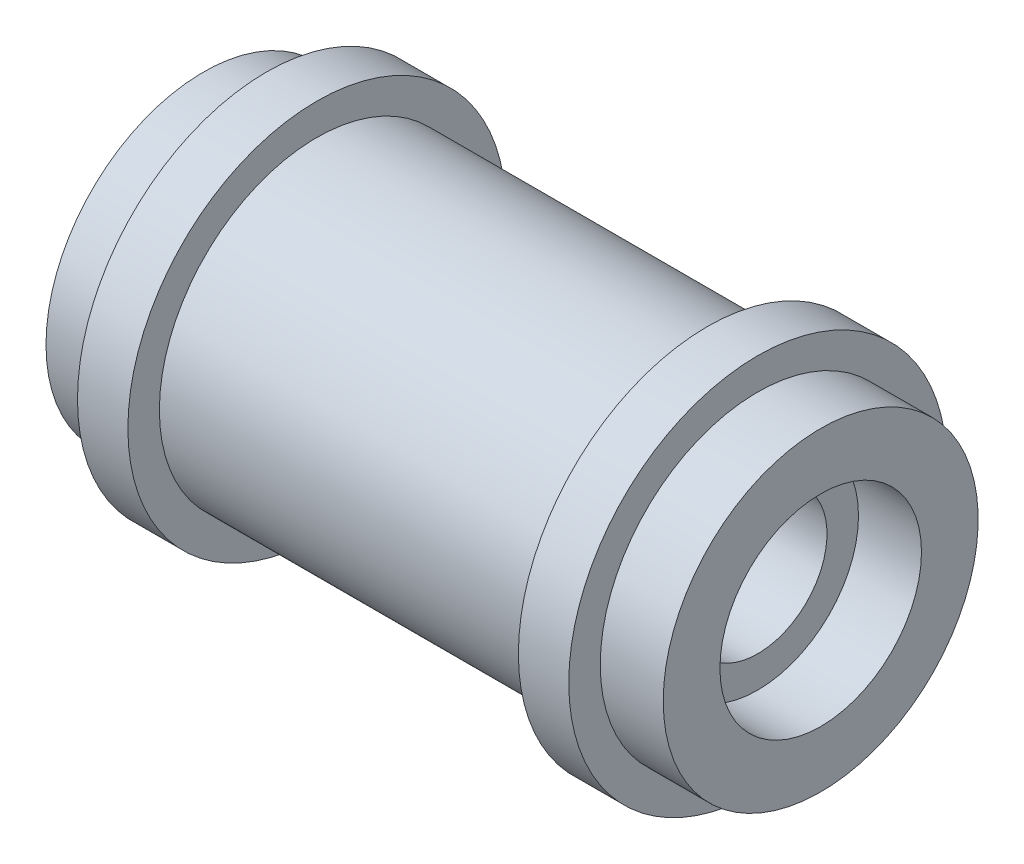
ISO-10303-21;
HEADER;
FILE_DESCRIPTION(('STEP AP214'),'2;1');
FILE_NAME('part.step','',(''),(''),'','','');
FILE_SCHEMA(('AUTOMOTIVE_DESIGN { 1 0 10303 214 1 1 1 1 }'));
ENDSEC;
DATA;
#1=APPLICATION_CONTEXT('core data for automotive mechanical design processes');
#2=APPLICATION_PROTOCOL_DEFINITION('international standard','automotive_design',2000,#1);
#3=PRODUCT_CONTEXT('',#1,'mechanical');
#4=PRODUCT('Part','Part','',(#3));
#5=PRODUCT_RELATED_PRODUCT_CATEGORY('part','',(#4));
#6=PRODUCT_DEFINITION_FORMATION('','',#4);
#7=PRODUCT_DEFINITION_CONTEXT('part definition',#1,'design');
#8=PRODUCT_DEFINITION('design','',#6,#7);
#9=PRODUCT_DEFINITION_SHAPE('','',#8);
#10=(LENGTH_UNIT() NAMED_UNIT(*) SI_UNIT(.MILLI.,.METRE.));
#11=(NAMED_UNIT(*) PLANE_ANGLE_UNIT() SI_UNIT($,.RADIAN.));
#12=(NAMED_UNIT(*) SI_UNIT($,.STERADIAN.) SOLID_ANGLE_UNIT());
#13=UNCERTAINTY_MEASURE_WITH_UNIT(LENGTH_MEASURE(1.E-05),#10,'distance_accuracy_value','');
#14=(GEOMETRIC_REPRESENTATION_CONTEXT(3) GLOBAL_UNCERTAINTY_ASSIGNED_CONTEXT((#13)) GLOBAL_UNIT_ASSIGNED_CONTEXT((#10,
#11,#12)) REPRESENTATION_CONTEXT('',''));
#15=CARTESIAN_POINT('',(0.,0.,0.));
#16=DIRECTION('',(0.,0.,1.));
#17=DIRECTION('',(1.,0.,0.));
#18=AXIS2_PLACEMENT_3D('',#15,#16,#17);
#19=CARTESIAN_POINT('',(-49.,25.,0.));
#20=DIRECTION('',(1.,0.,0.));
#21=DIRECTION('',(0.,0.,-1.));
#22=AXIS2_PLACEMENT_3D('',#19,#20,#21);
#23=PLANE('',#22);
#24=CARTESIAN_POINT('',(-49.,0.,0.));
#25=DIRECTION('',(-1.,0.,0.));
#26=DIRECTION('',(0.,0.,1.));
#27=AXIS2_PLACEMENT_3D('',#24,#25,#26);
#28=CIRCLE('',#27,16.);
#29=CARTESIAN_POINT('',(-49.,0.,16.));
#30=VERTEX_POINT('',#29);
#31=EDGE_CURVE('E10',#30,#30,#28,.T.);
#32=ORIENTED_EDGE('',*,*,#31,.F.);
#33=EDGE_LOOP('',(#32));
#34=FACE_BOUND('',#33,.T.);
#35=CARTESIAN_POINT('',(-49.,0.,0.));
#36=DIRECTION('',(-1.,0.,0.));
#37=DIRECTION('',(0.,0.,1.));
#38=AXIS2_PLACEMENT_3D('',#35,#36,#37);
#39=CIRCLE('',#38,25.);
#40=CARTESIAN_POINT('',(-49.,0.,25.));
#41=VERTEX_POINT('',#40);
#42=EDGE_CURVE('E80',#41,#41,#39,.T.);
#43=ORIENTED_EDGE('',*,*,#42,.T.);
#44=EDGE_LOOP('',(#43));
#45=FACE_BOUND('',#44,.T.);
#46=ADVANCED_FACE('F28',(#34,#45),#23,.F.);
#47=CARTESIAN_POINT('',(-49.,0.,0.));
#48=DIRECTION('',(-1.,0.,0.));
#49=DIRECTION('',(0.,0.,1.));
#50=AXIS2_PLACEMENT_3D('',#47,#48,#49);
#51=CYLINDRICAL_SURFACE('',#50,16.);
#52=CARTESIAN_POINT('',(-39.,0.,0.));
#53=DIRECTION('',(-1.,0.,0.));
#54=DIRECTION('',(0.,0.,1.));
#55=AXIS2_PLACEMENT_3D('',#52,#53,#54);
#56=CIRCLE('',#55,16.);
#57=CARTESIAN_POINT('',(-39.,0.,16.));
#58=VERTEX_POINT('',#57);
#59=EDGE_CURVE('E34',#58,#58,#56,.T.);
#60=ORIENTED_EDGE('',*,*,#59,.F.);
#61=EDGE_LOOP('',(#60));
#62=FACE_BOUND('',#61,.T.);
#63=ORIENTED_EDGE('',*,*,#31,.T.);
#64=EDGE_LOOP('',(#63));
#65=FACE_BOUND('',#64,.T.);
#66=ADVANCED_FACE('F165',(#62,#65),#51,.F.);
#67=CARTESIAN_POINT('',(-39.,16.,0.));
#68=DIRECTION('',(1.,0.,0.));
#69=DIRECTION('',(0.,0.,-1.));
#70=AXIS2_PLACEMENT_3D('',#67,#68,#69);
#71=PLANE('',#70);
#72=CARTESIAN_POINT('',(-39.,0.,0.));
#73=DIRECTION('',(-1.,0.,0.));
#74=DIRECTION('',(0.,0.,1.));
#75=AXIS2_PLACEMENT_3D('',#72,#73,#74);
#76=CIRCLE('',#75,11.);
#77=CARTESIAN_POINT('',(-39.,0.,11.));
#78=VERTEX_POINT('',#77);
#79=EDGE_CURVE('E38',#78,#78,#76,.T.);
#80=ORIENTED_EDGE('',*,*,#79,.F.);
#81=EDGE_LOOP('',(#80));
#82=FACE_BOUND('',#81,.T.);
#83=ORIENTED_EDGE('',*,*,#59,.T.);
#84=EDGE_LOOP('',(#83));
#85=FACE_BOUND('',#84,.T.);
#86=ADVANCED_FACE('F160',(#82,#85),#71,.F.);
#87=CARTESIAN_POINT('',(-49.,0.,0.));
#88=DIRECTION('',(-1.,0.,0.));
#89=DIRECTION('',(0.,0.,1.));
#90=AXIS2_PLACEMENT_3D('',#87,#88,#89);
#91=CYLINDRICAL_SURFACE('',#90,11.);
#92=CARTESIAN_POINT('',(39.,0.,0.));
#93=DIRECTION('',(-1.,0.,0.));
#94=DIRECTION('',(0.,0.,1.));
#95=AXIS2_PLACEMENT_3D('',#92,#93,#94);
#96=CIRCLE('',#95,11.);
#97=CARTESIAN_POINT('',(39.,0.,11.));
#98=VERTEX_POINT('',#97);
#99=EDGE_CURVE('E42',#98,#98,#96,.T.);
#100=ORIENTED_EDGE('',*,*,#99,.F.);
#101=EDGE_LOOP('',(#100));
#102=FACE_BOUND('',#101,.T.);
#103=ORIENTED_EDGE('',*,*,#79,.T.);
#104=EDGE_LOOP('',(#103));
#105=FACE_BOUND('',#104,.T.);
#106=ADVANCED_FACE('F154',(#102,#105),#91,.F.);
#107=CARTESIAN_POINT('',(39.,16.,0.));
#108=DIRECTION('',(-1.,0.,0.));
#109=DIRECTION('',(0.,0.,1.));
#110=AXIS2_PLACEMENT_3D('',#107,#108,#109);
#111=PLANE('',#110);
#112=CARTESIAN_POINT('',(39.,0.,0.));
#113=DIRECTION('',(-1.,0.,0.));
#114=DIRECTION('',(0.,0.,1.));
#115=AXIS2_PLACEMENT_3D('',#112,#113,#114);
#116=CIRCLE('',#115,16.);
#117=CARTESIAN_POINT('',(39.,0.,16.));
#118=VERTEX_POINT('',#117);
#119=EDGE_CURVE('E47',#118,#118,#116,.T.);
#120=ORIENTED_EDGE('',*,*,#119,.F.);
#121=EDGE_LOOP('',(#120));
#122=FACE_BOUND('',#121,.T.);
#123=ORIENTED_EDGE('',*,*,#99,.T.);
#124=EDGE_LOOP('',(#123));
#125=FACE_BOUND('',#124,.T.);
#126=ADVANCED_FACE('F148',(#122,#125),#111,.F.);
#127=CARTESIAN_POINT('',(-49.,0.,0.));
#128=DIRECTION('',(-1.,0.,0.));
#129=DIRECTION('',(0.,0.,1.));
#130=AXIS2_PLACEMENT_3D('',#127,#128,#129);
#131=CYLINDRICAL_SURFACE('',#130,16.);
#132=CARTESIAN_POINT('',(49.,0.,0.));
#133=DIRECTION('',(-1.,0.,0.));
#134=DIRECTION('',(0.,0.,1.));
#135=AXIS2_PLACEMENT_3D('',#132,#133,#134);
#136=CIRCLE('',#135,16.);
#137=CARTESIAN_POINT('',(49.,0.,16.));
#138=VERTEX_POINT('',#137);
#139=EDGE_CURVE('E50',#138,#138,#136,.T.);
#140=ORIENTED_EDGE('',*,*,#139,.F.);
#141=EDGE_LOOP('',(#140));
#142=FACE_BOUND('',#141,.T.);
#143=ORIENTED_EDGE('',*,*,#119,.T.);
#144=EDGE_LOOP('',(#143));
#145=FACE_BOUND('',#144,.T.);
#146=ADVANCED_FACE('F142',(#142,#145),#131,.F.);
#147=CARTESIAN_POINT('',(49.,25.,0.));
#148=DIRECTION('',(-1.,0.,0.));
#149=DIRECTION('',(0.,0.,1.));
#150=AXIS2_PLACEMENT_3D('',#147,#148,#149);
#151=PLANE('',#150);
#152=CARTESIAN_POINT('',(49.,0.,0.));
#153=DIRECTION('',(-1.,0.,0.));
#154=DIRECTION('',(0.,0.,1.));
#155=AXIS2_PLACEMENT_3D('',#152,#153,#154);
#156=CIRCLE('',#155,25.);
#157=CARTESIAN_POINT('',(49.,0.,25.));
#158=VERTEX_POINT('',#157);
#159=EDGE_CURVE('E53',#158,#158,#156,.T.);
#160=ORIENTED_EDGE('',*,*,#159,.F.);
#161=EDGE_LOOP('',(#160));
#162=FACE_BOUND('',#161,.T.);
#163=ORIENTED_EDGE('',*,*,#139,.T.);
#164=EDGE_LOOP('',(#163));
#165=FACE_BOUND('',#164,.T.);
#166=ADVANCED_FACE('F136',(#162,#165),#151,.F.);
#167=CARTESIAN_POINT('',(-49.,0.,0.));
#168=DIRECTION('',(-1.,0.,0.));
#169=DIRECTION('',(0.,0.,1.));
#170=AXIS2_PLACEMENT_3D('',#167,#168,#169);
#171=CYLINDRICAL_SURFACE('',#170,25.);
#172=CARTESIAN_POINT('',(39.,0.,0.));
#173=DIRECTION('',(-1.,0.,0.));
#174=DIRECTION('',(0.,0.,1.));
#175=AXIS2_PLACEMENT_3D('',#172,#173,#174);
#176=CIRCLE('',#175,25.);
#177=CARTESIAN_POINT('',(39.,0.,25.));
#178=VERTEX_POINT('',#177);
#179=EDGE_CURVE('E56',#178,#178,#176,.T.);
#180=ORIENTED_EDGE('',*,*,#179,.F.);
#181=EDGE_LOOP('',(#180));
#182=FACE_BOUND('',#181,.T.);
#183=ORIENTED_EDGE('',*,*,#159,.T.);
#184=EDGE_LOOP('',(#183));
#185=FACE_BOUND('',#184,.T.);
#186=ADVANCED_FACE('F130',(#182,#185),#171,.T.);
#187=CARTESIAN_POINT('',(39.,30.,0.));
#188=DIRECTION('',(-1.,0.,0.));
#189=DIRECTION('',(0.,0.,1.));
#190=AXIS2_PLACEMENT_3D('',#187,#188,#189);
#191=PLANE('',#190);
#192=CARTESIAN_POINT('',(39.,0.,0.));
#193=DIRECTION('',(-1.,0.,0.));
#194=DIRECTION('',(0.,0.,1.));
#195=AXIS2_PLACEMENT_3D('',#192,#193,#194);
#196=CIRCLE('',#195,30.);
#197=CARTESIAN_POINT('',(39.,0.,30.));
#198=VERTEX_POINT('',#197);
#199=EDGE_CURVE('E59',#198,#198,#196,.T.);
#200=ORIENTED_EDGE('',*,*,#199,.F.);
#201=EDGE_LOOP('',(#200));
#202=FACE_BOUND('',#201,.T.);
#203=ORIENTED_EDGE('',*,*,#179,.T.);
#204=EDGE_LOOP('',(#203));
#205=FACE_BOUND('',#204,.T.);
#206=ADVANCED_FACE('F124',(#202,#205),#191,.F.);
#207=CARTESIAN_POINT('',(-49.,0.,0.));
#208=DIRECTION('',(-1.,0.,0.));
#209=DIRECTION('',(0.,0.,1.));
#210=AXIS2_PLACEMENT_3D('',#207,#208,#209);
#211=CYLINDRICAL_SURFACE('',#210,30.);
#212=CARTESIAN_POINT('',(31.,0.,0.));
#213=DIRECTION('',(-1.,0.,0.));
#214=DIRECTION('',(0.,0.,1.));
#215=AXIS2_PLACEMENT_3D('',#212,#213,#214);
#216=CIRCLE('',#215,30.);
#217=CARTESIAN_POINT('',(31.,0.,30.));
#218=VERTEX_POINT('',#217);
#219=EDGE_CURVE('E62',#218,#218,#216,.T.);
#220=ORIENTED_EDGE('',*,*,#219,.F.);
#221=EDGE_LOOP('',(#220));
#222=FACE_BOUND('',#221,.T.);
#223=ORIENTED_EDGE('',*,*,#199,.T.);
#224=EDGE_LOOP('',(#223));
#225=FACE_BOUND('',#224,.T.);
#226=ADVANCED_FACE('F118',(#222,#225),#211,.T.);
#227=CARTESIAN_POINT('',(31.,25.,0.));
#228=DIRECTION('',(1.,0.,0.));
#229=DIRECTION('',(0.,0.,-1.));
#230=AXIS2_PLACEMENT_3D('',#227,#228,#229);
#231=PLANE('',#230);
#232=CARTESIAN_POINT('',(31.,0.,0.));
#233=DIRECTION('',(-1.,0.,0.));
#234=DIRECTION('',(0.,0.,1.));
#235=AXIS2_PLACEMENT_3D('',#232,#233,#234);
#236=CIRCLE('',#235,25.);
#237=CARTESIAN_POINT('',(31.,0.,25.));
#238=VERTEX_POINT('',#237);
#239=EDGE_CURVE('E65',#238,#238,#236,.T.);
#240=ORIENTED_EDGE('',*,*,#239,.F.);
#241=EDGE_LOOP('',(#240));
#242=FACE_BOUND('',#241,.T.);
#243=ORIENTED_EDGE('',*,*,#219,.T.);
#244=EDGE_LOOP('',(#243));
#245=FACE_BOUND('',#244,.T.);
#246=ADVANCED_FACE('F112',(#242,#245),#231,.F.);
#247=CARTESIAN_POINT('',(-49.,0.,0.));
#248=DIRECTION('',(-1.,0.,0.));
#249=DIRECTION('',(0.,0.,1.));
#250=AXIS2_PLACEMENT_3D('',#247,#248,#249);
#251=CYLINDRICAL_SURFACE('',#250,25.);
#252=CARTESIAN_POINT('',(-31.,0.,0.));
#253=DIRECTION('',(-1.,0.,0.));
#254=DIRECTION('',(0.,0.,1.));
#255=AXIS2_PLACEMENT_3D('',#252,#253,#254);
#256=CIRCLE('',#255,25.);
#257=CARTESIAN_POINT('',(-31.,0.,25.));
#258=VERTEX_POINT('',#257);
#259=EDGE_CURVE('E68',#258,#258,#256,.T.);
#260=ORIENTED_EDGE('',*,*,#259,.F.);
#261=EDGE_LOOP('',(#260));
#262=FACE_BOUND('',#261,.T.);
#263=ORIENTED_EDGE('',*,*,#239,.T.);
#264=EDGE_LOOP('',(#263));
#265=FACE_BOUND('',#264,.T.);
#266=ADVANCED_FACE('F106',(#262,#265),#251,.T.);
#267=CARTESIAN_POINT('',(-31.,25.,0.));
#268=DIRECTION('',(-1.,0.,0.));
#269=DIRECTION('',(0.,0.,1.));
#270=AXIS2_PLACEMENT_3D('',#267,#268,#269);
#271=PLANE('',#270);
#272=CARTESIAN_POINT('',(-31.,0.,0.));
#273=DIRECTION('',(-1.,0.,0.));
#274=DIRECTION('',(0.,0.,1.));
#275=AXIS2_PLACEMENT_3D('',#272,#273,#274);
#276=CIRCLE('',#275,30.);
#277=CARTESIAN_POINT('',(-31.,0.,30.));
#278=VERTEX_POINT('',#277);
#279=EDGE_CURVE('E71',#278,#278,#276,.T.);
#280=ORIENTED_EDGE('',*,*,#279,.F.);
#281=EDGE_LOOP('',(#280));
#282=FACE_BOUND('',#281,.T.);
#283=ORIENTED_EDGE('',*,*,#259,.T.);
#284=EDGE_LOOP('',(#283));
#285=FACE_BOUND('',#284,.T.);
#286=ADVANCED_FACE('F100',(#282,#285),#271,.F.);
#287=CARTESIAN_POINT('',(-49.,0.,0.));
#288=DIRECTION('',(-1.,0.,0.));
#289=DIRECTION('',(0.,0.,1.));
#290=AXIS2_PLACEMENT_3D('',#287,#288,#289);
#291=CYLINDRICAL_SURFACE('',#290,30.);
#292=CARTESIAN_POINT('',(-39.,0.,0.));
#293=DIRECTION('',(-1.,0.,0.));
#294=DIRECTION('',(0.,0.,1.));
#295=AXIS2_PLACEMENT_3D('',#292,#293,#294);
#296=CIRCLE('',#295,30.);
#297=CARTESIAN_POINT('',(-39.,0.,30.));
#298=VERTEX_POINT('',#297);
#299=EDGE_CURVE('E74',#298,#298,#296,.T.);
#300=ORIENTED_EDGE('',*,*,#299,.F.);
#301=EDGE_LOOP('',(#300));
#302=FACE_BOUND('',#301,.T.);
#303=ORIENTED_EDGE('',*,*,#279,.T.);
#304=EDGE_LOOP('',(#303));
#305=FACE_BOUND('',#304,.T.);
#306=ADVANCED_FACE('F94',(#302,#305),#291,.T.);
#307=CARTESIAN_POINT('',(-39.,30.,0.));
#308=DIRECTION('',(1.,0.,0.));
#309=DIRECTION('',(0.,0.,-1.));
#310=AXIS2_PLACEMENT_3D('',#307,#308,#309);
#311=PLANE('',#310);
#312=CARTESIAN_POINT('',(-39.,0.,0.));
#313=DIRECTION('',(-1.,0.,0.));
#314=DIRECTION('',(0.,0.,1.));
#315=AXIS2_PLACEMENT_3D('',#312,#313,#314);
#316=CIRCLE('',#315,25.);
#317=CARTESIAN_POINT('',(-39.,0.,25.));
#318=VERTEX_POINT('',#317);
#319=EDGE_CURVE('E77',#318,#318,#316,.T.);
#320=ORIENTED_EDGE('',*,*,#319,.F.);
#321=EDGE_LOOP('',(#320));
#322=FACE_BOUND('',#321,.T.);
#323=ORIENTED_EDGE('',*,*,#299,.T.);
#324=EDGE_LOOP('',(#323));
#325=FACE_BOUND('',#324,.T.);
#326=ADVANCED_FACE('F88',(#322,#325),#311,.F.);
#327=CARTESIAN_POINT('',(-49.,0.,0.));
#328=DIRECTION('',(-1.,0.,0.));
#329=DIRECTION('',(0.,0.,1.));
#330=AXIS2_PLACEMENT_3D('',#327,#328,#329);
#331=CYLINDRICAL_SURFACE('',#330,25.);
#332=ORIENTED_EDGE('',*,*,#42,.F.);
#333=EDGE_LOOP('',(#332));
#334=FACE_BOUND('',#333,.T.);
#335=ORIENTED_EDGE('',*,*,#319,.T.);
#336=EDGE_LOOP('',(#335));
#337=FACE_BOUND('',#336,.T.);
#338=ADVANCED_FACE('F85',(#334,#337),#331,.T.);
#339=CLOSED_SHELL('',(#46,#66,#86,#106,#126,#146,#166,#186,#206,#226,#246,#266,#286,#306,#326,#338));
#340=MANIFOLD_SOLID_BREP('B2',#339);
#341=ADVANCED_BREP_SHAPE_REPRESENTATION('',(#18,#340),#14);
#342=SHAPE_DEFINITION_REPRESENTATION(#9,#341);
ENDSEC;
END-ISO-10303-21;
